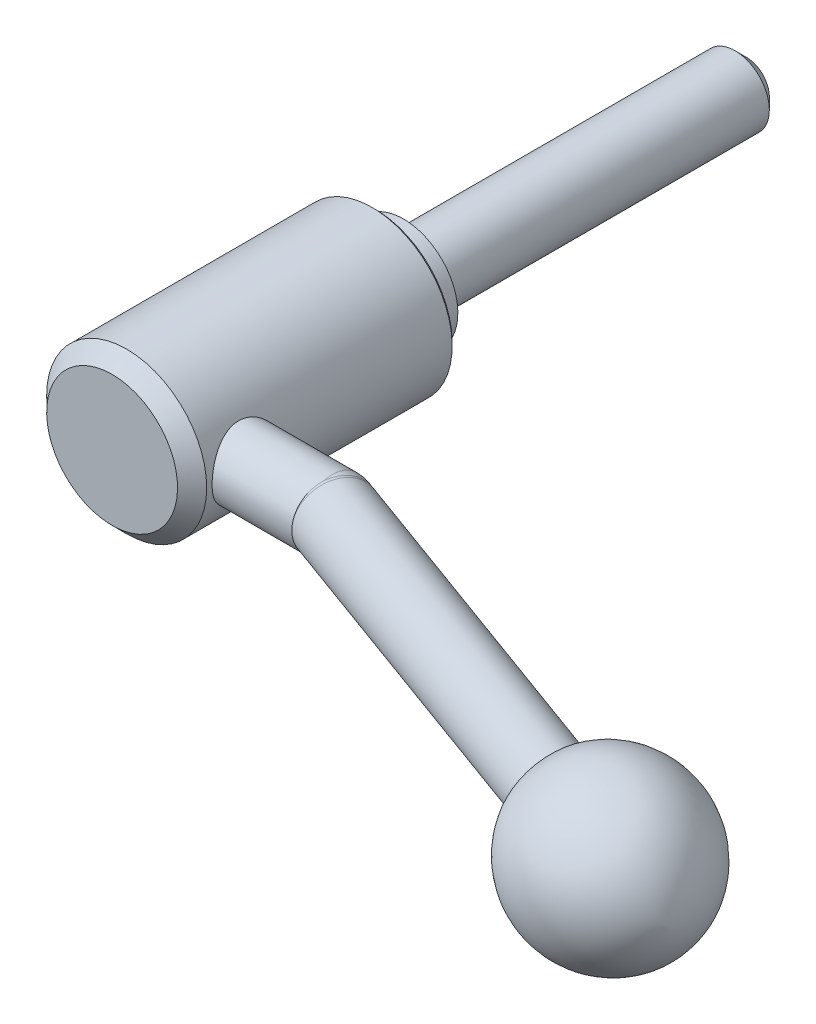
ISO-10303-21;
HEADER;
FILE_DESCRIPTION(('STEP AP214'),'2;1');
FILE_NAME('part.step','',(''),(''),'','','');
FILE_SCHEMA(('AUTOMOTIVE_DESIGN { 1 0 10303 214 1 1 1 1 }'));
ENDSEC;
DATA;
#1=APPLICATION_CONTEXT('core data for automotive mechanical design processes');
#2=APPLICATION_PROTOCOL_DEFINITION('international standard','automotive_design',2000,#1);
#3=PRODUCT_CONTEXT('',#1,'mechanical');
#4=PRODUCT('Part','Part','',(#3));
#5=PRODUCT_RELATED_PRODUCT_CATEGORY('part','',(#4));
#6=PRODUCT_DEFINITION_FORMATION('','',#4);
#7=PRODUCT_DEFINITION_CONTEXT('part definition',#1,'design');
#8=PRODUCT_DEFINITION('design','',#6,#7);
#9=PRODUCT_DEFINITION_SHAPE('','',#8);
#10=(LENGTH_UNIT() NAMED_UNIT(*) SI_UNIT(.MILLI.,.METRE.));
#11=(NAMED_UNIT(*) PLANE_ANGLE_UNIT() SI_UNIT($,.RADIAN.));
#12=(NAMED_UNIT(*) SI_UNIT($,.STERADIAN.) SOLID_ANGLE_UNIT());
#13=UNCERTAINTY_MEASURE_WITH_UNIT(LENGTH_MEASURE(1.E-05),#10,'distance_accuracy_value','');
#14=(GEOMETRIC_REPRESENTATION_CONTEXT(3) GLOBAL_UNCERTAINTY_ASSIGNED_CONTEXT((#13)) GLOBAL_UNIT_ASSIGNED_CONTEXT((#10,
#11,#12)) REPRESENTATION_CONTEXT('',''));
#15=CARTESIAN_POINT('',(0.,0.,0.));
#16=DIRECTION('',(0.,0.,1.));
#17=DIRECTION('',(1.,0.,0.));
#18=AXIS2_PLACEMENT_3D('',#15,#16,#17);
#19=CARTESIAN_POINT('',(0.,0.,-29.463244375));
#20=DIRECTION('',(0.,0.,1.));
#21=DIRECTION('',(0.,-1.,0.));
#22=AXIS2_PLACEMENT_3D('',#19,#20,#21);
#23=CYLINDRICAL_SURFACE('',#22,6.);
#24=CARTESIAN_POINT('',(0.,0.,-58.));
#25=DIRECTION('',(0.,0.,-1.));
#26=DIRECTION('',(-1.,0.,0.));
#27=AXIS2_PLACEMENT_3D('',#24,#25,#26);
#28=CIRCLE('',#27,6.);
#29=CARTESIAN_POINT('',(-6.,0.,-58.));
#30=VERTEX_POINT('',#29);
#31=EDGE_CURVE('E9',#30,#30,#28,.F.);
#32=ORIENTED_EDGE('',*,*,#31,.T.);
#33=EDGE_LOOP('',(#32));
#34=FACE_BOUND('',#33,.T.);
#35=CARTESIAN_POINT('',(0.,0.,0.));
#36=DIRECTION('',(0.,0.,1.));
#37=DIRECTION('',(0.,-1.,0.));
#38=AXIS2_PLACEMENT_3D('',#35,#36,#37);
#39=CIRCLE('',#38,6.);
#40=CARTESIAN_POINT('',(0.,-6.,0.));
#41=VERTEX_POINT('',#40);
#42=EDGE_CURVE('E158',#41,#41,#39,.T.);
#43=ORIENTED_EDGE('',*,*,#42,.F.);
#44=EDGE_LOOP('',(#43));
#45=FACE_BOUND('',#44,.T.);
#46=ADVANCED_FACE('F14',(#34,#45),#23,.T.);
#47=CARTESIAN_POINT('',(105.019293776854,0.,70.6944682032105));
#48=DIRECTION('',(0.,1.,0.));
#49=DIRECTION('',(0.342020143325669,0.,-0.939692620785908));
#50=AXIS2_PLACEMENT_3D('',#47,#48,#49);
#51=CIRCLE('',#50,16.);
#52=TRIMMED_CURVE('',#51,(PARAMETER_VALUE(-1.48106994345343)),
(PARAMETER_VALUE(1.48106994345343)),.T.,.PARAMETER.);
#53=CARTESIAN_POINT('',(105.509646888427,0.,69.3472341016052));
#54=DIRECTION('',(-0.939692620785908,0.,-0.342020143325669));
#55=AXIS1_PLACEMENT('',#53,#54);
#56=SURFACE_OF_REVOLUTION('',#52,#55);
#57=CARTESIAN_POINT('',(96.4885977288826,0.,66.0638407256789));
#58=DIRECTION('',(-0.939692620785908,0.,-0.342020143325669));
#59=DIRECTION('',(0.342020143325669,0.,-0.939692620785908));
#60=AXIS2_PLACEMENT_3D('',#57,#58,#59);
#61=CIRCLE('',#60,11.3663034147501);
#62=CARTESIAN_POINT('',(100.376102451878,0.,55.3830092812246));
#63=VERTEX_POINT('',#62);
#64=EDGE_CURVE('E155',#63,#63,#61,.T.);
#65=ORIENTED_EDGE('',*,*,#64,.F.);
#66=EDGE_LOOP('',(#65));
#67=FACE_BOUND('',#66,.T.);
#68=CARTESIAN_POINT('',(120.484247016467,1.10913882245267E-13,74.7975428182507));
#69=VERTEX_POINT('',#68);
#70=VERTEX_LOOP('',#69);
#71=FACE_BOUND('',#70,.T.);
#72=ADVANCED_FACE('F40',(#67,#71),#56,.T.);
#73=CARTESIAN_POINT('',(7.75,0.,0.));
#74=DIRECTION('',(0.,0.,-1.));
#75=DIRECTION('',(0.,1.,0.));
#76=AXIS2_PLACEMENT_3D('',#73,#74,#75);
#77=PLANE('',#76);
#78=ORIENTED_EDGE('',*,*,#42,.T.);
#79=EDGE_LOOP('',(#78));
#80=FACE_BOUND('',#79,.T.);
#81=CARTESIAN_POINT('',(0.,0.,0.));
#82=DIRECTION('',(0.,0.,1.));
#83=DIRECTION('',(0.,-1.,0.));
#84=AXIS2_PLACEMENT_3D('',#81,#82,#83);
#85=CIRCLE('',#84,9.5);
#86=CARTESIAN_POINT('',(0.,-9.5,0.));
#87=VERTEX_POINT('',#86);
#88=EDGE_CURVE('E152',#87,#87,#85,.T.);
#89=ORIENTED_EDGE('',*,*,#88,.F.);
#90=EDGE_LOOP('',(#89));
#91=FACE_BOUND('',#90,.T.);
#92=ADVANCED_FACE('F42',(#80,#91),#77,.T.);
#93=CARTESIAN_POINT('',(93.5187849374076,0.,74.2233343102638));
#94=DIRECTION('',(-0.939692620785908,0.,-0.342020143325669));
#95=DIRECTION('',(0.342020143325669,0.,-0.939692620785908));
#96=AXIS2_PLACEMENT_3D('',#93,#94,#95);
#97=PLANE('',#96);
#98=ORIENTED_EDGE('',*,*,#64,.T.);
#99=EDGE_LOOP('',(#98));
#100=FACE_BOUND('',#99,.T.);
#101=CARTESIAN_POINT('',(96.4885977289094,0.,66.0638407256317));
#102=DIRECTION('',(-0.939692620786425,0.,-0.342020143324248));
#103=DIRECTION('',(0.342020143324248,0.,-0.939692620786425));
#104=AXIS2_PLACEMENT_3D('',#101,#102,#103);
#105=CIRCLE('',#104,6.);
#106=CARTESIAN_POINT('',(98.5407185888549,0.,60.4256850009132));
#107=VERTEX_POINT('',#106);
#108=EDGE_CURVE('E149',#107,#107,#105,.T.);
#109=ORIENTED_EDGE('',*,*,#108,.F.);
#110=EDGE_LOOP('',(#109));
#111=FACE_BOUND('',#110,.T.);
#112=ADVANCED_FACE('F50',(#100,#111),#97,.T.);
#113=CARTESIAN_POINT('',(0.,0.,2.5));
#114=DIRECTION('',(0.,0.,1.));
#115=DIRECTION('',(0.,-1.,0.));
#116=AXIS2_PLACEMENT_3D('',#113,#114,#115);
#117=CYLINDRICAL_SURFACE('',#116,9.5);
#118=CARTESIAN_POINT('',(0.,0.,5.));
#119=DIRECTION('',(0.,0.,1.));
#120=DIRECTION('',(0.,-1.,0.));
#121=AXIS2_PLACEMENT_3D('',#118,#119,#120);
#122=CIRCLE('',#121,9.5);
#123=CARTESIAN_POINT('',(0.,-9.5,5.));
#124=VERTEX_POINT('',#123);
#125=EDGE_CURVE('E146',#124,#124,#122,.T.);
#126=ORIENTED_EDGE('',*,*,#125,.F.);
#127=EDGE_LOOP('',(#126));
#128=FACE_BOUND('',#127,.T.);
#129=ORIENTED_EDGE('',*,*,#88,.T.);
#130=EDGE_LOOP('',(#129));
#131=FACE_BOUND('',#130,.T.);
#132=ADVANCED_FACE('F174',(#128,#131),#117,.T.);
#133=CARTESIAN_POINT('',(63.2413783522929,0.,53.9628425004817));
#134=DIRECTION('',(-0.939692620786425,0.,-0.342020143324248));
#135=DIRECTION('',(0.342020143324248,0.,-0.939692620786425));
#136=AXIS2_PLACEMENT_3D('',#133,#134,#135);
#137=CYLINDRICAL_SURFACE('',#136,6.);
#138=CARTESIAN_POINT('',(29.9941589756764,0.,41.8618442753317));
#139=DIRECTION('',(-0.939692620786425,0.,-0.342020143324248));
#140=DIRECTION('',(0.342020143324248,0.,-0.939692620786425));
#141=AXIS2_PLACEMENT_3D('',#138,#139,#140);
#142=CIRCLE('',#141,6.);
#143=CARTESIAN_POINT('',(27.9420381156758,0.,47.5));
#144=VERTEX_POINT('',#143);
#145=EDGE_CURVE('E143',#144,#144,#142,.T.);
#146=ORIENTED_EDGE('',*,*,#145,.F.);
#147=EDGE_LOOP('',(#146));
#148=FACE_BOUND('',#147,.T.);
#149=ORIENTED_EDGE('',*,*,#108,.T.);
#150=EDGE_LOOP('',(#149));
#151=FACE_BOUND('',#150,.T.);
#152=ADVANCED_FACE('F176',(#148,#151),#137,.T.);
#153=CARTESIAN_POINT('',(11.5,0.,5.));
#154=DIRECTION('',(0.,0.,-1.));
#155=DIRECTION('',(0.,1.,0.));
#156=AXIS2_PLACEMENT_3D('',#153,#154,#155);
#157=PLANE('',#156);
#158=ORIENTED_EDGE('',*,*,#125,.T.);
#159=EDGE_LOOP('',(#158));
#160=FACE_BOUND('',#159,.T.);
#161=CARTESIAN_POINT('',(0.,0.,5.));
#162=DIRECTION('',(0.,0.,1.));
#163=DIRECTION('',(0.,-1.,0.));
#164=AXIS2_PLACEMENT_3D('',#161,#162,#163);
#165=CIRCLE('',#164,13.5);
#166=CARTESIAN_POINT('',(0.,-13.5,5.));
#167=VERTEX_POINT('',#166);
#168=EDGE_CURVE('E127',#167,#167,#165,.T.);
#169=ORIENTED_EDGE('',*,*,#168,.F.);
#170=EDGE_LOOP('',(#169));
#171=FACE_BOUND('',#170,.T.);
#172=ADVANCED_FACE('F184',(#160,#171),#157,.T.);
#173=CARTESIAN_POINT('',(5.725,0.,51.));
#174=DIRECTION('',(0.,0.,1.));
#175=DIRECTION('',(0.,-1.,0.));
#176=AXIS2_PLACEMENT_3D('',#173,#174,#175);
#177=PLANE('',#176);
#178=CARTESIAN_POINT('',(0.,0.,51.));
#179=DIRECTION('',(0.,0.,-1.));
#180=DIRECTION('',(0.,1.,0.));
#181=AXIS2_PLACEMENT_3D('',#178,#179,#180);
#182=CIRCLE('',#181,11.45);
#183=CARTESIAN_POINT('',(0.,11.45,51.));
#184=VERTEX_POINT('',#183);
#185=EDGE_CURVE('E93',#184,#184,#182,.T.);
#186=ORIENTED_EDGE('',*,*,#185,.F.);
#187=EDGE_LOOP('',(#186));
#188=FACE_BOUND('',#187,.T.);
#189=ADVANCED_FACE('F102',(#188),#177,.T.);
#190=CARTESIAN_POINT('',(29.9941589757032,0.,41.8618442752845));
#191=DIRECTION('',(1.,0.,0.));
#192=DIRECTION('',(0.,0.,1.));
#193=AXIS2_PLACEMENT_3D('',#190,#191,#192);
#194=SPHERICAL_SURFACE('',#193,6.);
#195=CARTESIAN_POINT('',(29.,5.79723335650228,43.0466368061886));
#196=CARTESIAN_POINT('',(29.0557645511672,5.8381271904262,42.8934249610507));
#197=CARTESIAN_POINT('',(29.1121209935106,5.87210735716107,42.7385869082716));
#198=CARTESIAN_POINT('',(29.2256095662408,5.92607580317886,42.426779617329));
#199=CARTESIAN_POINT('',(29.2827416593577,5.94606475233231,42.2698104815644));
#200=CARTESIAN_POINT('',(29.397338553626,5.97188107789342,41.9549581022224));
#201=CARTESIAN_POINT('',(29.4548030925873,5.97771840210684,41.797075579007));
#202=CARTESIAN_POINT('',(29.5696954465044,5.97522465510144,41.4814114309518));
#203=CARTESIAN_POINT('',(29.6271232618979,5.96689375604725,41.3236298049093));
#204=CARTESIAN_POINT('',(29.7415513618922,5.93611715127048,41.0092411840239));
#205=CARTESIAN_POINT('',(29.7985515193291,5.91366740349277,40.8526345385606));
#206=CARTESIAN_POINT('',(29.9117233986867,5.85479849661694,40.5416973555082));
#207=CARTESIAN_POINT('',(29.967894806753,5.81837417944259,40.3873676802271));
#208=CARTESIAN_POINT('',(30.07895660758,5.73184022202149,40.082227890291));
#209=CARTESIAN_POINT('',(30.1338477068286,5.68173833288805,39.9314158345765));
#210=CARTESIAN_POINT('',(30.2420117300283,5.56817525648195,39.634237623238));
#211=CARTESIAN_POINT('',(30.2952840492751,5.50470914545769,39.4878731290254));
#212=CARTESIAN_POINT('',(30.3997923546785,5.3649043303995,39.200738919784));
#213=CARTESIAN_POINT('',(30.4510290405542,5.28857009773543,39.0599672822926));
#214=CARTESIAN_POINT('',(30.5511400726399,5.12352558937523,38.7849144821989));
#215=CARTESIAN_POINT('',(30.6000135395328,5.03481075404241,38.6506357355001));
#216=CARTESIAN_POINT('',(30.6950199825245,4.8456778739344,38.3896076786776));
#217=CARTESIAN_POINT('',(30.741153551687,4.74526237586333,38.2628567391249));
#218=CARTESIAN_POINT('',(30.8303803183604,4.53338722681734,38.0177082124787));
#219=CARTESIAN_POINT('',(30.8734723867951,4.42192351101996,37.899313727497));
#220=CARTESIAN_POINT('',(30.9562737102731,4.1888241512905,37.6718189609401));
#221=CARTESIAN_POINT('',(30.9959843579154,4.06719273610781,37.5627148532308));
#222=CARTESIAN_POINT('',(31.0717745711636,3.81453588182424,37.3544829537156));
#223=CARTESIAN_POINT('',(31.1078527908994,3.68350699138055,37.2553588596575));
#224=CARTESIAN_POINT('',(31.1760900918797,3.41308529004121,37.0678784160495));
#225=CARTESIAN_POINT('',(31.2082508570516,3.27369611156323,36.9795174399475));
#226=CARTESIAN_POINT('',(31.2684539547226,2.98744059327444,36.8141107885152));
#227=CARTESIAN_POINT('',(31.2964947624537,2.84057151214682,36.7370693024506));
#228=CARTESIAN_POINT('',(31.3482353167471,2.54049920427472,36.5949132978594));
#229=CARTESIAN_POINT('',(31.371936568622,2.38729819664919,36.5297946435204));
#230=CARTESIAN_POINT('',(31.4148496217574,2.07554959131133,36.4118919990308));
#231=CARTESIAN_POINT('',(31.4340597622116,1.91700004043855,36.3591125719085));
#232=CARTESIAN_POINT('',(31.4678364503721,1.59577604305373,36.2663118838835));
#233=CARTESIAN_POINT('',(31.482404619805,1.43310305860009,36.2262861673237));
#234=CARTESIAN_POINT('',(31.5068088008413,1.10473356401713,36.1592362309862));
#235=CARTESIAN_POINT('',(31.5166430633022,0.939035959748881,36.132216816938));
#236=CARTESIAN_POINT('',(31.5389073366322,0.439292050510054,36.0710462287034));
#237=CARTESIAN_POINT('',(31.5441357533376,0.10224239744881,36.0566812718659));
#238=CARTESIAN_POINT('',(31.5351589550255,-0.569455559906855,36.0813448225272));
#239=CARTESIAN_POINT('',(31.5209537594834,-0.904103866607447,36.120373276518));
#240=CARTESIAN_POINT('',(31.4735308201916,-1.56172931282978,36.2506667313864));
#241=CARTESIAN_POINT('',(31.4403129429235,-1.88470637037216,36.3419320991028));
#242=CARTESIAN_POINT('',(31.3558032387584,-2.50975337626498,36.5741206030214));
#243=CARTESIAN_POINT('',(31.3045116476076,-2.81182359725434,36.715043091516));
#244=CARTESIAN_POINT('',(31.1853123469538,-3.38650029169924,37.042540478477));
#245=CARTESIAN_POINT('',(31.1174048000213,-3.65910705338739,37.2291149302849));
#246=CARTESIAN_POINT('',(30.9668980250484,-4.16712588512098,37.6426288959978));
#247=CARTESIAN_POINT('',(30.8842983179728,-4.4025367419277,37.8695697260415));
#248=CARTESIAN_POINT('',(30.7067542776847,-4.82947107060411,38.357367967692));
#249=CARTESIAN_POINT('',(30.6118099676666,-5.02099462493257,38.6182253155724));
#250=CARTESIAN_POINT('',(30.4122730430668,-5.35471233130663,39.1664485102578));
#251=CARTESIAN_POINT('',(30.3076807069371,-5.49690790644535,39.4538135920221));
#252=CARTESIAN_POINT('',(30.0918053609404,-5.72795934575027,40.0469262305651));
#253=CARTESIAN_POINT('',(29.9805214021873,-5.81680762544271,40.3526763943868));
#254=CARTESIAN_POINT('',(29.7544411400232,-5.93858745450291,40.9738268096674));
#255=CARTESIAN_POINT('',(29.6396457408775,-5.97153327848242,41.2892245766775));
#256=CARTESIAN_POINT('',(29.4363937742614,-5.97959153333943,41.847654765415));
#257=CARTESIAN_POINT('',(29.347976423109,-5.96630208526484,42.0905794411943));
#258=CARTESIAN_POINT('',(29.2164293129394,-5.92144536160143,42.4520021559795));
#259=CARTESIAN_POINT('',(29.1727720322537,-5.90234809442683,42.5719495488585));
#260=CARTESIAN_POINT('',(29.0859636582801,-5.85593456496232,42.8104535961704));
#261=CARTESIAN_POINT('',(29.0428126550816,-5.8286168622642,42.929010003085));
#262=CARTESIAN_POINT('',(29.,-5.79723335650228,43.0466368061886));
#263=B_SPLINE_CURVE_WITH_KNOTS('',3,(#195,#196,#197,#198,#199,#200,#201,#202,#203,#204,#205,
#206,#207,#208,#209,#210,#211,#212,#213,#214,#215,#216,#217,#218,#219,#220,#221,#222,#223,#224,
#225,#226,#227,#228,#229,#230,#231,#232,#233,#234,#235,#236,#237,#238,#239,#240,#241,#242,#243,
#244,#245,#246,#247,#248,#249,#250,#251,#252,#253,#254,#255,#256,#257,#258,#259,#260,#261,#262),
.UNSPECIFIED.,.F.,.F.,(4,2,2,2,2,2,2,2,2,2,2,2,2,2,2,2,2,2,2,2,2,2,2,2,2,2,2,2,2,2,2,2,2,4),(0.,
0.504130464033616,1.00823678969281,1.51198865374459,2.01573439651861,2.51962442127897,
3.02370061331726,3.52749173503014,4.03146879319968,4.53527109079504,5.03925942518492,
5.54313826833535,6.04720318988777,6.55105950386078,7.05510182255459,7.5589267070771,
8.06293758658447,8.56677330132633,9.07079504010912,9.57464049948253,10.0786719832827,
11.0856436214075,12.0926142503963,13.0995919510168,14.1065565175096,15.1135112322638,
16.1204987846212,17.127484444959,18.1344410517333,19.141540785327,20.1483833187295,
20.9227248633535,21.3096814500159,21.6967058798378),.UNSPECIFIED.);
#264=CARTESIAN_POINT('',(29.,5.79723335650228,43.0466368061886));
#265=VERTEX_POINT('',#264);
#266=CARTESIAN_POINT('',(29.,-5.79723335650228,43.0466368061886));
#267=VERTEX_POINT('',#266);
#268=EDGE_CURVE('E132',#265,#267,#263,.T.);
#269=ORIENTED_EDGE('',*,*,#268,.F.);
#270=CARTESIAN_POINT('',(27.9420381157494,0.,47.5));
#271=CARTESIAN_POINT('',(27.9420394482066,0.166535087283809,47.5000193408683));
#272=CARTESIAN_POINT('',(27.9432607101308,0.333067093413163,47.4930673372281));
#273=CARTESIAN_POINT('',(27.9481523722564,0.664932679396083,47.4653605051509));
#274=CARTESIAN_POINT('',(27.9518226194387,0.830266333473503,47.4446065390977));
#275=CARTESIAN_POINT('',(27.9616185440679,1.15846404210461,47.3894524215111));
#276=CARTESIAN_POINT('',(27.9677427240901,1.3213295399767,47.3550605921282));
#277=CARTESIAN_POINT('',(27.9824660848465,1.64353559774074,47.2729046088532));
#278=CARTESIAN_POINT('',(27.9910652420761,1.80287619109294,47.2251405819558));
#279=CARTESIAN_POINT('',(28.0107684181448,2.11692207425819,47.1166045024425));
#280=CARTESIAN_POINT('',(28.0218726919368,2.27162689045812,47.0558311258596));
#281=CARTESIAN_POINT('',(28.04663219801,2.5753638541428,46.921722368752));
#282=CARTESIAN_POINT('',(28.0602885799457,2.72439340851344,46.8483813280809));
#283=CARTESIAN_POINT('',(28.0902001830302,3.01561279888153,46.6897555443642));
#284=CARTESIAN_POINT('',(28.1064544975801,3.15780499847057,46.6044749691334));
#285=CARTESIAN_POINT('',(28.1416340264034,3.43435878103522,46.4226570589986));
#286=CARTESIAN_POINT('',(28.1605580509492,3.5687238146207,46.3261247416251));
#287=CARTESIAN_POINT('',(28.2012637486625,3.82927101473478,46.122138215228));
#288=CARTESIAN_POINT('',(28.2230560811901,3.95541989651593,46.014643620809));
#289=CARTESIAN_POINT('',(28.2695844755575,4.19811456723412,45.789893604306));
#290=CARTESIAN_POINT('',(28.2943205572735,4.31466029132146,45.6726381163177));
#291=CARTESIAN_POINT('',(28.3469412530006,4.53741042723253,45.4292656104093));
#292=CARTESIAN_POINT('',(28.3748269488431,4.64361126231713,45.3031455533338));
#293=CARTESIAN_POINT('',(28.4340144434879,4.84493909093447,45.0431060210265));
#294=CARTESIAN_POINT('',(28.4653162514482,4.94006605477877,44.9091865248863));
#295=CARTESIAN_POINT('',(28.53102556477,5.1167627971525,44.6375840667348));
#296=CARTESIAN_POINT('',(28.5653535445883,5.19857640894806,44.5000402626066));
#297=CARTESIAN_POINT('',(28.6381984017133,5.35056421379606,44.2197177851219));
#298=CARTESIAN_POINT('',(28.6767149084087,5.42073943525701,44.0769395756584));
#299=CARTESIAN_POINT('',(28.7382572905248,5.51700566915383,43.8598578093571));
#300=CARTESIAN_POINT('',(28.7594066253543,5.54760321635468,43.7869880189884));
#301=CARTESIAN_POINT('',(28.8031193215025,5.60576725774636,43.6404635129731));
#302=CARTESIAN_POINT('',(28.825682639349,5.63333384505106,43.5668088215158));
#303=CARTESIAN_POINT('',(28.8724170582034,5.68541693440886,43.4189007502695));
#304=CARTESIAN_POINT('',(28.8965887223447,5.7099323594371,43.344647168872));
#305=CARTESIAN_POINT('',(28.9468138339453,5.75589127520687,43.1958172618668));
#306=CARTESIAN_POINT('',(28.9728674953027,5.77733441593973,43.1212409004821));
#307=CARTESIAN_POINT('',(29.,5.79723335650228,43.0466368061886));
#308=B_SPLINE_CURVE_WITH_KNOTS('',3,(#270,#271,#272,#273,#274,#275,#276,#277,#278,#279,#280,
#281,#282,#283,#284,#285,#286,#287,#288,#289,#290,#291,#292,#293,#294,#295,#296,#297,#298,#299,
#300,#301,#302,#303,#304,#305,#306,#307),.UNSPECIFIED.,.F.,.F.,(4,2,2,2,2,2,2,2,2,2,2,2,2,2,2,2,
2,2,4),(0.,0.499451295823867,0.998871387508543,1.4979871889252,1.99709825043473,
2.49626013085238,2.99564741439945,3.49486080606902,3.9938524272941,4.49475374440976,
4.99565844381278,5.49673572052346,5.99781434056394,6.488313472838,6.97876923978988,
7.2241520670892,7.46952735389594,7.71498901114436,7.96047861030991),.UNSPECIFIED.);
#309=EDGE_CURVE('E86',#144,#265,#308,.T.);
#310=ORIENTED_EDGE('',*,*,#309,.F.);
#311=ORIENTED_EDGE('',*,*,#145,.T.);
#312=CARTESIAN_POINT('',(29.,-5.79723335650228,43.0466368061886));
#313=CARTESIAN_POINT('',(28.9723130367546,-5.77692718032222,43.122768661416));
#314=CARTESIAN_POINT('',(28.9457482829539,-5.75501279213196,43.1988708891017));
#315=CARTESIAN_POINT('',(28.8945727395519,-5.70798462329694,43.3507333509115));
#316=CARTESIAN_POINT('',(28.8699617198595,-5.68287122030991,43.4264936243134));
#317=CARTESIAN_POINT('',(28.822404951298,-5.62946641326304,43.5773816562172));
#318=CARTESIAN_POINT('',(28.7994586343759,-5.60117610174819,43.6525096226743));
#319=CARTESIAN_POINT('',(28.7550276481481,-5.5414411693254,43.8019353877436));
#320=CARTESIAN_POINT('',(28.7335430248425,-5.50999644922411,43.8762331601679));
#321=CARTESIAN_POINT('',(28.671065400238,-5.41102236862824,44.0974817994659));
#322=CARTESIAN_POINT('',(28.6320085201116,-5.33880726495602,44.2429178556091));
#323=CARTESIAN_POINT('',(28.5582125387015,-5.18229062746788,44.5282604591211));
#324=CARTESIAN_POINT('',(28.5234737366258,-5.0979882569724,44.6681666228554));
#325=CARTESIAN_POINT('',(28.4577828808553,-4.91785982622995,44.9411288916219));
#326=CARTESIAN_POINT('',(28.4268278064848,-4.82204308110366,45.0741904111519));
#327=CARTESIAN_POINT('',(28.3682949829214,-4.61943382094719,45.3324629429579));
#328=CARTESIAN_POINT('',(28.3407171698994,-4.51264151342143,45.4576741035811));
#329=CARTESIAN_POINT('',(28.2886811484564,-4.28880603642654,45.6991954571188));
#330=CARTESIAN_POINT('',(28.2642219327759,-4.17176619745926,45.8155085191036));
#331=CARTESIAN_POINT('',(28.2182226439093,-3.92818288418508,46.0383508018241));
#332=CARTESIAN_POINT('',(28.1966825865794,-3.80163935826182,46.1448799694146));
#333=CARTESIAN_POINT('',(28.1561746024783,-3.5385495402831,46.3483613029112));
#334=CARTESIAN_POINT('',(28.1372355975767,-3.40191329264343,46.4452029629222));
#335=CARTESIAN_POINT('',(28.1020833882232,-3.12070655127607,46.6273056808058));
#336=CARTESIAN_POINT('',(28.0858714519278,-2.97613240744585,46.7125613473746));
#337=CARTESIAN_POINT('',(28.0561017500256,-2.68008378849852,46.8707849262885));
#338=CARTESIAN_POINT('',(28.0425448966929,-2.52860696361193,46.9437486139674));
#339=CARTESIAN_POINT('',(28.0180414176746,-2.21995704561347,47.076738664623));
#340=CARTESIAN_POINT('',(28.0070935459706,-2.06278671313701,47.1367712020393));
#341=CARTESIAN_POINT('',(27.9881595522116,-1.75042855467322,47.2412531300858));
#342=CARTESIAN_POINT('',(27.9800695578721,-1.59542814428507,47.2862448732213));
#343=CARTESIAN_POINT('',(27.9662176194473,-1.28221071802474,47.3636132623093));
#344=CARTESIAN_POINT('',(27.9604556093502,-1.12399379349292,47.3959902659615));
#345=CARTESIAN_POINT('',(27.9512410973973,-0.805364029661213,47.447893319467));
#346=CARTESIAN_POINT('',(27.9477891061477,-0.644950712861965,47.4674165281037));
#347=CARTESIAN_POINT('',(27.9431881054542,-0.323025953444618,47.4934789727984));
#348=CARTESIAN_POINT('',(27.9420393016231,-0.16151441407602,47.5000170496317));
#349=CARTESIAN_POINT('',(27.9420381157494,0.,47.5));
#350=B_SPLINE_CURVE_WITH_KNOTS('',3,(#312,#313,#314,#315,#316,#317,#318,#319,#320,#321,#322,
#323,#324,#325,#326,#327,#328,#329,#330,#331,#332,#333,#334,#335,#336,#337,#338,#339,#340,#341,
#342,#343,#344,#345,#346,#347,#348,#349),.UNSPECIFIED.,.F.,.F.,(4,2,2,2,2,2,2,2,2,2,2,2,2,2,2,2,
2,2,4),(0.,0.250514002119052,0.50099845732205,0.751397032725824,1.0018034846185,
1.50218745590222,2.00260608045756,2.50262255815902,3.00262958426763,3.50247470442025,
4.0023225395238,4.50734262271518,5.01259690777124,5.51802449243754,6.02321020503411,
6.50747629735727,6.99172865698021,7.47608802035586,7.96049062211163),.UNSPECIFIED.);
#351=EDGE_CURVE('E129',#267,#144,#350,.T.);
#352=ORIENTED_EDGE('',*,*,#351,.F.);
#353=EDGE_LOOP('',(#269,#310,#311,#352));
#354=FACE_BOUND('',#353,.T.);
#355=ADVANCED_FACE('F95',(#354),#194,.T.);
#356=CARTESIAN_POINT('',(29.,0.,41.5));
#357=DIRECTION('',(1.,0.,0.));
#358=DIRECTION('',(0.,0.,1.));
#359=AXIS2_PLACEMENT_3D('',#356,#357,#358);
#360=SPHERICAL_SURFACE('',#359,6.);
#361=CARTESIAN_POINT('',(29.,0.,41.5));
#362=DIRECTION('',(-1.,0.,0.));
#363=DIRECTION('',(0.,-1.,0.));
#364=AXIS2_PLACEMENT_3D('',#361,#362,#363);
#365=CIRCLE('',#364,6.);
#366=EDGE_CURVE('E29',#265,#267,#365,.T.);
#367=ORIENTED_EDGE('',*,*,#366,.F.);
#368=ORIENTED_EDGE('',*,*,#268,.T.);
#369=EDGE_LOOP('',(#367,#368));
#370=FACE_BOUND('',#369,.T.);
#371=ADVANCED_FACE('F101',(#370),#360,.T.);
#372=CARTESIAN_POINT('',(0.,0.,5.5));
#373=DIRECTION('',(0.,0.,1.));
#374=DIRECTION('',(0.,-1.,0.));
#375=AXIS2_PLACEMENT_3D('',#372,#373,#374);
#376=CONICAL_SURFACE('',#375,14.,0.785398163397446);
#377=ORIENTED_EDGE('',*,*,#168,.T.);
#378=EDGE_LOOP('',(#377));
#379=FACE_BOUND('',#378,.T.);
#380=CARTESIAN_POINT('',(0.,0.,5.5));
#381=DIRECTION('',(0.,0.,1.));
#382=DIRECTION('',(0.,-1.,0.));
#383=AXIS2_PLACEMENT_3D('',#380,#381,#382);
#384=CIRCLE('',#383,14.);
#385=CARTESIAN_POINT('',(0.,-14.,5.5));
#386=VERTEX_POINT('',#385);
#387=EDGE_CURVE('E114',#386,#386,#384,.T.);
#388=ORIENTED_EDGE('',*,*,#387,.F.);
#389=EDGE_LOOP('',(#388));
#390=FACE_BOUND('',#389,.T.);
#391=ADVANCED_FACE('F123',(#379,#390),#376,.T.);
#392=CARTESIAN_POINT('',(0.,0.,48.45));
#393=DIRECTION('',(0.,0.,-1.));
#394=DIRECTION('',(0.,1.,0.));
#395=AXIS2_PLACEMENT_3D('',#392,#393,#394);
#396=CONICAL_SURFACE('',#395,14.,0.785398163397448);
#397=CARTESIAN_POINT('',(0.,0.,48.45));
#398=DIRECTION('',(0.,0.,1.));
#399=DIRECTION('',(0.,-1.,0.));
#400=AXIS2_PLACEMENT_3D('',#397,#398,#399);
#401=CIRCLE('',#400,14.);
#402=CARTESIAN_POINT('',(0.,-14.,48.45));
#403=VERTEX_POINT('',#402);
#404=EDGE_CURVE('E84',#403,#403,#401,.F.);
#405=ORIENTED_EDGE('',*,*,#404,.F.);
#406=EDGE_LOOP('',(#405));
#407=FACE_BOUND('',#406,.T.);
#408=ORIENTED_EDGE('',*,*,#185,.T.);
#409=EDGE_LOOP('',(#408));
#410=FACE_BOUND('',#409,.T.);
#411=ADVANCED_FACE('F69',(#407,#410),#396,.T.);
#412=CARTESIAN_POINT('',(14.5,0.,41.5));
#413=DIRECTION('',(-1.,0.,0.));
#414=DIRECTION('',(0.,-1.,0.));
#415=AXIS2_PLACEMENT_3D('',#412,#413,#414);
#416=CYLINDRICAL_SURFACE('',#415,6.);
#417=ORIENTED_EDGE('',*,*,#351,.T.);
#418=ORIENTED_EDGE('',*,*,#309,.T.);
#419=ORIENTED_EDGE('',*,*,#366,.T.);
#420=EDGE_LOOP('',(#417,#418,#419));
#421=FACE_BOUND('',#420,.T.);
#422=CARTESIAN_POINT('',(14.,0.,47.5));
#423=CARTESIAN_POINT('',(14.0000042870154,0.160603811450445,47.500005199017));
#424=CARTESIAN_POINT('',(13.9972323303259,0.321156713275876,47.4935493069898));
#425=CARTESIAN_POINT('',(13.9862285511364,0.641089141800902,47.4678085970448));
#426=CARTESIAN_POINT('',(13.9779959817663,0.80046850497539,47.4485220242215));
#427=CARTESIAN_POINT('',(13.9562800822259,1.11687883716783,47.3973118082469));
#428=CARTESIAN_POINT('',(13.9427945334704,1.27390878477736,47.3653828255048));
#429=CARTESIAN_POINT('',(13.9109210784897,1.58450451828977,47.2892074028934));
#430=CARTESIAN_POINT('',(13.8925312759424,1.73806893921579,47.2449561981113));
#431=CARTESIAN_POINT('',(13.8513869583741,2.04015832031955,47.1447320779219));
#432=CARTESIAN_POINT('',(13.8286466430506,2.18869787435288,47.0887972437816));
#433=CARTESIAN_POINT('',(13.7793155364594,2.48039457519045,46.9655944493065));
#434=CARTESIAN_POINT('',(13.7527233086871,2.62354968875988,46.8983222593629));
#435=CARTESIAN_POINT('',(13.696336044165,2.90357801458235,46.7530090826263));
#436=CARTESIAN_POINT('',(13.6665419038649,3.04045296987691,46.6749711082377));
#437=CARTESIAN_POINT('',(13.6044405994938,3.30726420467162,46.5086670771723));
#438=CARTESIAN_POINT('',(13.5721325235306,3.43719793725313,46.4203973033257));
#439=CARTESIAN_POINT('',(13.4693866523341,3.82753947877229,46.1322418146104));
#440=CARTESIAN_POINT('',(13.3958896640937,4.07523678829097,45.9158607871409));
#441=CARTESIAN_POINT('',(13.2483283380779,4.53206518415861,45.4456195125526));
#442=CARTESIAN_POINT('',(13.1742637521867,4.74117826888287,45.1917418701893));
#443=CARTESIAN_POINT('',(13.0667151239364,5.02713542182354,44.7799219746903));
#444=CARTESIAN_POINT('',(13.0306067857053,5.11975828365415,44.6334016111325));
#445=CARTESIAN_POINT('',(12.9615135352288,5.29223870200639,44.3323606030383));
#446=CARTESIAN_POINT('',(12.9285273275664,5.3721015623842,44.177843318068));
#447=CARTESIAN_POINT('',(12.8667726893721,5.51837579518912,43.8617502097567));
#448=CARTESIAN_POINT('',(12.8380044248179,5.58478663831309,43.700174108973));
#449=CARTESIAN_POINT('',(12.7857296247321,5.70344853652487,43.371158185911));
#450=CARTESIAN_POINT('',(12.7622203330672,5.75570701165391,43.2037214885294));
#451=CARTESIAN_POINT('',(12.7223620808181,5.84326126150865,42.8726417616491));
#452=CARTESIAN_POINT('',(12.7057155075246,5.87927054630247,42.7092232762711));
#453=CARTESIAN_POINT('',(12.6785875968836,5.9375461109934,42.3795189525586));
#454=CARTESIAN_POINT('',(12.668103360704,5.95981885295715,42.2132345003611));
#455=CARTESIAN_POINT('',(12.6536916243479,5.99035682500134,41.879148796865));
#456=CARTESIAN_POINT('',(12.6497622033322,5.99862615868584,41.7113480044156));
#457=CARTESIAN_POINT('',(12.6486085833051,6.00105865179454,41.3756258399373));
#458=CARTESIAN_POINT('',(12.6513839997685,5.99522262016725,41.2077044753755));
#459=CARTESIAN_POINT('',(12.6630276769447,5.9705855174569,40.8869641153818));
#460=CARTESIAN_POINT('',(12.6713756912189,5.95289101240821,40.7340395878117));
#461=CARTESIAN_POINT('',(12.6933550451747,5.90587935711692,40.4303228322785));
#462=CARTESIAN_POINT('',(12.7069881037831,5.87655842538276,40.2795313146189));
#463=CARTESIAN_POINT('',(12.7391074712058,5.80660124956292,39.9811658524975));
#464=CARTESIAN_POINT('',(12.7575927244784,5.76596746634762,39.8335912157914));
#465=CARTESIAN_POINT('',(12.7988726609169,5.67374743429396,39.5424712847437));
#466=CARTESIAN_POINT('',(12.8216690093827,5.62215695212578,39.3989275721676));
#467=CARTESIAN_POINT('',(12.8714548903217,5.50723592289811,39.1136873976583));
#468=CARTESIAN_POINT('',(12.8985238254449,5.44367744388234,38.9720964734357));
#469=CARTESIAN_POINT('',(12.9557327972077,5.30608601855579,38.6947444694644));
#470=CARTESIAN_POINT('',(12.9858738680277,5.23204954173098,38.5589853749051));
#471=CARTESIAN_POINT('',(13.0797518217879,4.99489125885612,38.161420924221));
#472=CARTESIAN_POINT('',(13.1469738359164,4.81665343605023,37.9091627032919));
#473=CARTESIAN_POINT('',(13.2528981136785,4.51370688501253,37.5434052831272));
#474=CARTESIAN_POINT('',(13.2906740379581,4.40149613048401,37.4189560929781));
#475=CARTESIAN_POINT('',(13.3660382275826,4.16703298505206,37.1798351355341));
#476=CARTESIAN_POINT('',(13.4036265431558,4.04478345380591,37.0651606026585));
#477=CARTESIAN_POINT('',(13.4776589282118,3.79080787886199,36.8461921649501));
#478=CARTESIAN_POINT('',(13.5141019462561,3.65907347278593,36.7419076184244));
#479=CARTESIAN_POINT('',(13.5848454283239,3.3869928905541,36.5445477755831));
#480=CARTESIAN_POINT('',(13.6191467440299,3.2466501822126,36.4514680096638));
#481=CARTESIAN_POINT('',(13.6855986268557,2.95422844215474,36.2748216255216));
#482=CARTESIAN_POINT('',(13.7176667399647,2.80193548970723,36.1915774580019));
#483=CARTESIAN_POINT('',(13.7776826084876,2.49011177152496,36.0383605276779));
#484=CARTESIAN_POINT('',(13.805632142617,2.33058416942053,35.9683820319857));
#485=CARTESIAN_POINT('',(13.8565730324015,2.00558982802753,35.8424448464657));
#486=CARTESIAN_POINT('',(13.8795716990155,1.84013227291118,35.7864654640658));
#487=CARTESIAN_POINT('',(13.9199625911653,1.50439957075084,35.6890342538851));
#488=CARTESIAN_POINT('',(13.9373571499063,1.33412646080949,35.6475763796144));
#489=CARTESIAN_POINT('',(13.9675766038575,0.971306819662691,35.5759495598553));
#490=CARTESIAN_POINT('',(13.9796957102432,0.778357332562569,35.547506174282));
#491=CARTESIAN_POINT('',(13.9959066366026,0.390262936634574,35.5095324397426));
#492=CARTESIAN_POINT('',(13.9999986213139,0.19511807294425,35.5000017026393));
#493=CARTESIAN_POINT('',(14.0000011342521,-0.160524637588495,35.49999859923));
#494=CARTESIAN_POINT('',(13.9972335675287,-0.32103114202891,35.5064468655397));
#495=CARTESIAN_POINT('',(13.986238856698,-0.640878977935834,35.5321682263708));
#496=CARTESIAN_POINT('',(13.9780101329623,-0.800219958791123,35.5514450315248));
#497=CARTESIAN_POINT('',(13.9562992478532,-1.11664192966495,35.6026425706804));
#498=CARTESIAN_POINT('',(13.9428121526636,-1.27372065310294,35.6345751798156));
#499=CARTESIAN_POINT('',(13.9109322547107,-1.58441204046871,35.7107657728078));
#500=CARTESIAN_POINT('',(13.8925375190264,-1.73802331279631,35.7550286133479));
#501=CARTESIAN_POINT('',(13.8513855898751,-2.04016815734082,35.8552712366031));
#502=CARTESIAN_POINT('',(13.8286436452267,-2.18871740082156,35.9112101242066));
#503=CARTESIAN_POINT('',(13.7793086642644,-2.4804334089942,36.0344228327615));
#504=CARTESIAN_POINT('',(13.7527141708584,-2.6235981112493,36.1017009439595));
#505=CARTESIAN_POINT('',(13.6963259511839,-2.90362509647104,36.2470172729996));
#506=CARTESIAN_POINT('',(13.6665335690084,-3.04048999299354,36.3250509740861));
#507=CARTESIAN_POINT('',(13.6044361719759,-3.30728201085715,36.4913450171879));
#508=CARTESIAN_POINT('',(13.5721302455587,-3.43720658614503,36.579609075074));
#509=CARTESIAN_POINT('',(13.4693921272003,-3.82751869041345,36.8677428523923));
#510=CARTESIAN_POINT('',(13.3959012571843,-4.07519777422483,37.0841052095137));
#511=CARTESIAN_POINT('',(13.2483400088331,-4.53203219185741,37.5543403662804));
#512=CARTESIAN_POINT('',(13.1742692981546,-4.74116344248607,37.808236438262));
#513=CARTESIAN_POINT('',(13.0666998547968,-5.02717606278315,38.2201367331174));
#514=CARTESIAN_POINT('',(13.0305770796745,-5.11983460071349,38.366719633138));
#515=CARTESIAN_POINT('',(12.9614574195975,-5.29237662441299,38.6678920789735));
#516=CARTESIAN_POINT('',(12.9284592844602,-5.37226522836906,38.8224783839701));
#517=CARTESIAN_POINT('',(12.8667153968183,-5.51850899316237,39.1385696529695));
#518=CARTESIAN_POINT('',(12.8379657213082,-5.58487666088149,39.3000680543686));
#519=CARTESIAN_POINT('',(12.7857155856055,-5.70347823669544,39.6289316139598));
#520=CARTESIAN_POINT('',(12.7622136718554,-5.75571605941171,39.7962951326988));
#521=CARTESIAN_POINT('',(12.7118372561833,-5.86638870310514,40.2148386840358));
#522=CARTESIAN_POINT('',(12.6884912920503,-5.91637540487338,40.4687465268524));
#523=CARTESIAN_POINT('',(12.657134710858,-5.9831725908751,40.981815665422));
#524=CARTESIAN_POINT('',(12.6491204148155,-5.99999103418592,41.2409756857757));
#525=CARTESIAN_POINT('',(12.64910460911,-6.00000553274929,41.6598423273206));
#526=CARTESIAN_POINT('',(12.6521467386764,-5.99360993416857,41.8196329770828));
#527=CARTESIAN_POINT('',(12.6641937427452,-5.96811672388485,42.1380179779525));
#528=CARTESIAN_POINT('',(12.6731994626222,-5.94901731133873,42.296612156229));
#529=CARTESIAN_POINT('',(12.6968742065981,-5.89831833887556,42.6114334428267));
#530=CARTESIAN_POINT('',(12.7115461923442,-5.86671224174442,42.7676592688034));
#531=CARTESIAN_POINT('',(12.746064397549,-5.79133489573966,43.0766221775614));
#532=CARTESIAN_POINT('',(12.7659126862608,-5.74755878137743,43.2293578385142));
#533=CARTESIAN_POINT('',(12.8100610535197,-5.64847418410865,43.529688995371));
#534=CARTESIAN_POINT('',(12.834343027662,-5.59321247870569,43.6773025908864));
#535=CARTESIAN_POINT('',(12.8866851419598,-5.47153830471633,43.967187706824));
#536=CARTESIAN_POINT('',(12.9147467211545,-5.4051215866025,44.1094571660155));
#537=CARTESIAN_POINT('',(13.0034189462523,-5.18991043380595,44.5269988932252));
#538=CARTESIAN_POINT('',(13.0685550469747,-5.02507375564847,44.7932486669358));
#539=CARTESIAN_POINT('',(13.2082253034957,-4.64606613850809,45.3109346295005));
#540=CARTESIAN_POINT('',(13.2830881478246,-4.42954152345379,45.5605439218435));
#541=CARTESIAN_POINT('',(13.4311388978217,-3.9579535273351,46.0214096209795));
#542=CARTESIAN_POINT('',(13.5043260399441,-3.70287296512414,46.2326488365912));
#543=CARTESIAN_POINT('',(13.6088643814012,-3.2894404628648,46.5209248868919));
#544=CARTESIAN_POINT('',(13.6435464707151,-3.14284381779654,46.6139789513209));
#545=CARTESIAN_POINT('',(13.7094572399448,-2.84156827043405,46.7873100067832));
#546=CARTESIAN_POINT('',(13.7406873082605,-2.68689265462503,46.8675921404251));
#547=CARTESIAN_POINT('',(13.7987727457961,-2.37059090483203,47.0145887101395));
#548=CARTESIAN_POINT('',(13.8256317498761,-2.20897068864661,47.0813144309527));
#549=CARTESIAN_POINT('',(13.8742091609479,-1.87989388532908,47.200581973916));
#550=CARTESIAN_POINT('',(13.8959288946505,-1.71243881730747,47.25312745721));
#551=CARTESIAN_POINT('',(13.9424931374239,-1.29234447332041,47.3648830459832));
#552=CARTESIAN_POINT('',(13.9639369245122,-1.03695928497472,47.4154416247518));
#553=CARTESIAN_POINT('',(13.9926857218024,-0.521004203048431,47.4829931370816));
#554=CARTESIAN_POINT('',(13.9999930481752,-0.26043516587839,47.4999915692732));
#555=CARTESIAN_POINT('',(14.,0.,47.5));
#556=B_SPLINE_CURVE_WITH_KNOTS('',3,(#422,#423,#424,#425,#426,#427,#428,#429,#430,#431,#432,
#433,#434,#435,#436,#437,#438,#439,#440,#441,#442,#443,#444,#445,#446,#447,#448,#449,#450,#451,
#452,#453,#454,#455,#456,#457,#458,#459,#460,#461,#462,#463,#464,#465,#466,#467,#468,#469,#470,
#471,#472,#473,#474,#475,#476,#477,#478,#479,#480,#481,#482,#483,#484,#485,#486,#487,#488,#489,
#490,#491,#492,#493,#494,#495,#496,#497,#498,#499,#500,#501,#502,#503,#504,#505,#506,#507,#508,
#509,#510,#511,#512,#513,#514,#515,#516,#517,#518,#519,#520,#521,#522,#523,#524,#525,#526,#527,
#528,#529,#530,#531,#532,#533,#534,#535,#536,#537,#538,#539,#540,#541,#542,#543,#544,#545,#546,
#547,#548,#549,#550,#551,#552,#553,#554,#555),.UNSPECIFIED.,.T.,.F.,(4,2,2,2,2,2,2,2,2,2,2,2,2,
2,2,2,2,2,2,2,2,2,2,2,2,2,2,2,2,2,2,2,2,2,2,2,2,2,2,2,2,2,2,2,2,2,2,2,2,2,2,2,2,2,2,2,2,2,2,2,2,
2,2,2,2,2,4),(0.,0.481570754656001,0.963207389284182,1.44504766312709,1.92707452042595,
2.40755412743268,2.88821338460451,3.36873841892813,3.84943857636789,4.85583642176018,
5.86270262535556,6.39332434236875,6.92372492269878,7.45414636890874,7.98428917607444,
8.48810428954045,8.9916822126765,9.49511254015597,9.99851399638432,10.4604850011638,
10.9226063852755,11.3846273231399,11.8468270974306,12.3189335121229,12.7911993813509,
13.7351926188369,14.2500685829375,14.764798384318,15.2799876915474,15.7949708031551,
16.3237783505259,16.852356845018,17.3801493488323,17.9077218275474,18.4928647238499,
19.0779956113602,19.5593857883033,20.0409152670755,20.5228976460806,21.0050701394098,
21.4855813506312,21.9662747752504,22.4467669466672,22.9274341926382,23.9337529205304,
24.9406982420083,25.4715381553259,26.002164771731,26.532298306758,27.0622848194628,
27.8391472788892,28.6158232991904,29.0951053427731,29.574455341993,30.0540562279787,
30.5338491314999,31.0117249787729,31.4897832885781,32.4451284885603,33.4573762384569,
34.4700763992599,35.0007105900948,35.5311305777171,36.0611072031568,36.5909468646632,
37.3719900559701,38.1529052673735),.UNSPECIFIED.);
#557=CARTESIAN_POINT('',(14.,0.,47.5));
#558=VERTEX_POINT('',#557);
#559=EDGE_CURVE('E77',#558,#558,#556,.T.);
#560=ORIENTED_EDGE('',*,*,#559,.F.);
#561=EDGE_LOOP('',(#560));
#562=FACE_BOUND('',#561,.T.);
#563=ADVANCED_FACE('F60',(#421,#562),#416,.T.);
#564=CARTESIAN_POINT('',(0.,0.,26.975));
#565=DIRECTION('',(0.,0.,1.));
#566=DIRECTION('',(0.,-1.,0.));
#567=AXIS2_PLACEMENT_3D('',#564,#565,#566);
#568=CYLINDRICAL_SURFACE('',#567,14.);
#569=ORIENTED_EDGE('',*,*,#404,.T.);
#570=EDGE_LOOP('',(#569));
#571=FACE_BOUND('',#570,.T.);
#572=ORIENTED_EDGE('',*,*,#387,.T.);
#573=EDGE_LOOP('',(#572));
#574=FACE_BOUND('',#573,.T.);
#575=ORIENTED_EDGE('',*,*,#559,.T.);
#576=EDGE_LOOP('',(#575));
#577=FACE_BOUND('',#576,.T.);
#578=ADVANCED_FACE('F58',(#571,#574,#577),#568,.T.);
#579=CARTESIAN_POINT('',(2.463244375,0.,-60.));
#580=DIRECTION('',(0.,0.,-1.));
#581=DIRECTION('',(0.,1.,0.));
#582=AXIS2_PLACEMENT_3D('',#579,#580,#581);
#583=PLANE('',#582);
#584=CARTESIAN_POINT('',(0.,0.,-60.));
#585=DIRECTION('',(0.,0.,-1.));
#586=DIRECTION('',(-1.,0.,0.));
#587=AXIS2_PLACEMENT_3D('',#584,#585,#586);
#588=CIRCLE('',#587,4.);
#589=CARTESIAN_POINT('',(-4.,0.,-60.));
#590=VERTEX_POINT('',#589);
#591=EDGE_CURVE('E23',#590,#590,#588,.T.);
#592=ORIENTED_EDGE('',*,*,#591,.T.);
#593=EDGE_LOOP('',(#592));
#594=FACE_BOUND('',#593,.T.);
#595=ADVANCED_FACE('F55',(#594),#583,.T.);
#596=CARTESIAN_POINT('',(0.,0.,-60.));
#597=DIRECTION('',(0.,0.,1.));
#598=DIRECTION('',(1.,0.,0.));
#599=AXIS2_PLACEMENT_3D('',#596,#597,#598);
#600=CONICAL_SURFACE('',#599,4.,0.785398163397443);
#601=ORIENTED_EDGE('',*,*,#31,.F.);
#602=EDGE_LOOP('',(#601));
#603=FACE_BOUND('',#602,.T.);
#604=ORIENTED_EDGE('',*,*,#591,.F.);
#605=EDGE_LOOP('',(#604));
#606=FACE_BOUND('',#605,.T.);
#607=ADVANCED_FACE('F16',(#603,#606),#600,.T.);
#608=CLOSED_SHELL('',(#46,#72,#92,#112,#132,#152,#172,#189,#355,#371,#391,#411,#563,#578,#595,#607));
#609=MANIFOLD_SOLID_BREP('B1',#608);
#610=ADVANCED_BREP_SHAPE_REPRESENTATION('',(#18,#609),#14);
#611=SHAPE_DEFINITION_REPRESENTATION(#9,#610);
ENDSEC;
END-ISO-10303-21;
